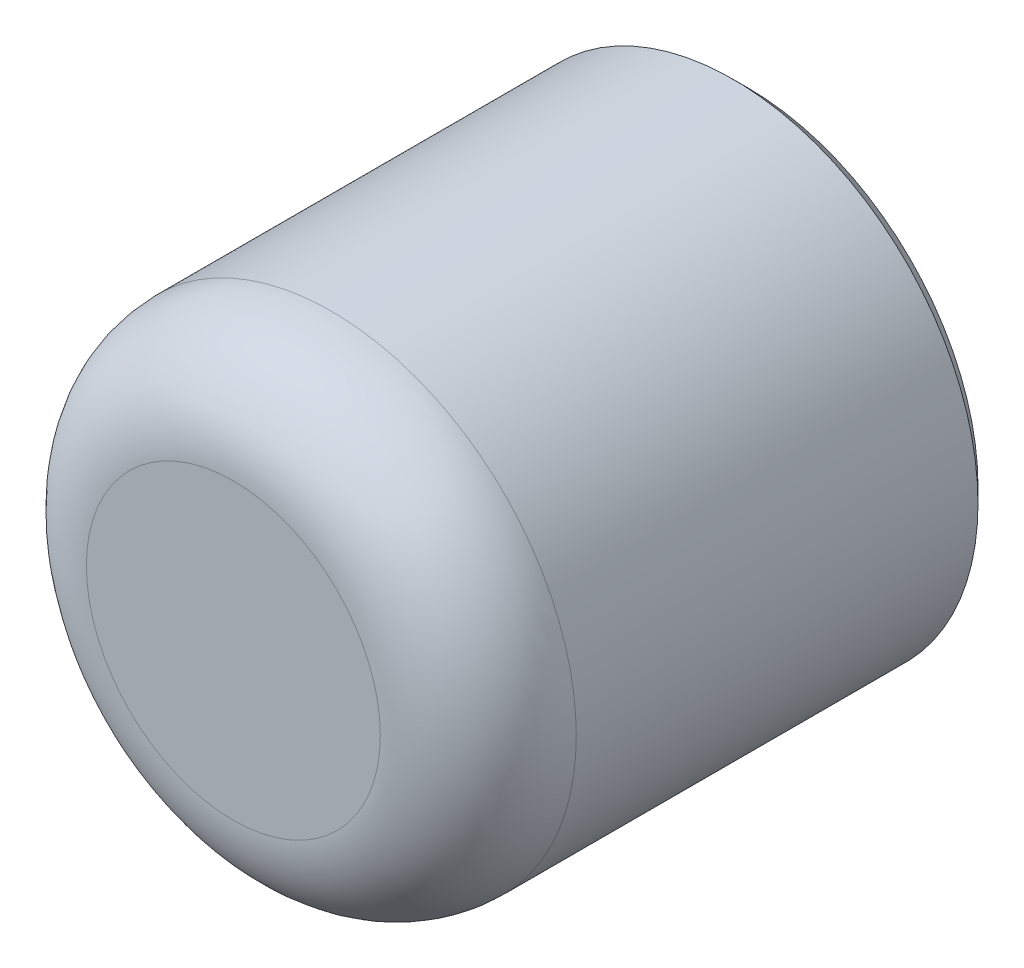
ISO-10303-21;
HEADER;
FILE_DESCRIPTION(('STEP AP214'),'2;1');
FILE_NAME('part.step','',(''),(''),'','','');
FILE_SCHEMA(('AUTOMOTIVE_DESIGN { 1 0 10303 214 1 1 1 1 }'));
ENDSEC;
DATA;
#1=APPLICATION_CONTEXT('core data for automotive mechanical design processes');
#2=APPLICATION_PROTOCOL_DEFINITION('international standard','automotive_design',2000,#1);
#3=PRODUCT_CONTEXT('',#1,'mechanical');
#4=PRODUCT('Part','Part','',(#3));
#5=PRODUCT_RELATED_PRODUCT_CATEGORY('part','',(#4));
#6=PRODUCT_DEFINITION_FORMATION('','',#4);
#7=PRODUCT_DEFINITION_CONTEXT('part definition',#1,'design');
#8=PRODUCT_DEFINITION('design','',#6,#7);
#9=PRODUCT_DEFINITION_SHAPE('','',#8);
#10=(LENGTH_UNIT() NAMED_UNIT(*) SI_UNIT(.MILLI.,.METRE.));
#11=(NAMED_UNIT(*) PLANE_ANGLE_UNIT() SI_UNIT($,.RADIAN.));
#12=(NAMED_UNIT(*) SI_UNIT($,.STERADIAN.) SOLID_ANGLE_UNIT());
#13=UNCERTAINTY_MEASURE_WITH_UNIT(LENGTH_MEASURE(1.E-05),#10,'distance_accuracy_value','');
#14=(GEOMETRIC_REPRESENTATION_CONTEXT(3) GLOBAL_UNCERTAINTY_ASSIGNED_CONTEXT((#13)) GLOBAL_UNIT_ASSIGNED_CONTEXT((#10,
#11,#12)) REPRESENTATION_CONTEXT('',''));
#15=CARTESIAN_POINT('',(0.,0.,0.));
#16=DIRECTION('',(0.,0.,1.));
#17=DIRECTION('',(1.,0.,0.));
#18=AXIS2_PLACEMENT_3D('',#15,#16,#17);
#19=CARTESIAN_POINT('',(0.,0.,8.5));
#20=DIRECTION('',(0.,0.,-1.));
#21=DIRECTION('',(-1.,0.,0.));
#22=AXIS2_PLACEMENT_3D('',#19,#20,#21);
#23=CYLINDRICAL_SURFACE('',#22,5.);
#24=CARTESIAN_POINT('',(0.,0.,0.300000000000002));
#25=DIRECTION('',(0.,0.,1.));
#26=DIRECTION('',(1.,0.,0.));
#27=AXIS2_PLACEMENT_3D('',#24,#25,#26);
#28=CIRCLE('',#27,5.);
#29=CARTESIAN_POINT('',(5.,0.,0.300000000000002));
#30=VERTEX_POINT('',#29);
#31=EDGE_CURVE('E49',#30,#30,#28,.T.);
#32=ORIENTED_EDGE('',*,*,#31,.T.);
#33=EDGE_LOOP('',(#32));
#34=FACE_BOUND('',#33,.T.);
#35=CARTESIAN_POINT('',(0.,0.,8.5));
#36=DIRECTION('',(0.,0.,1.));
#37=DIRECTION('',(1.,0.,0.));
#38=AXIS2_PLACEMENT_3D('',#35,#36,#37);
#39=CIRCLE('',#38,5.);
#40=CARTESIAN_POINT('',(5.,0.,8.5));
#41=VERTEX_POINT('',#40);
#42=EDGE_CURVE('E64',#41,#41,#39,.F.);
#43=ORIENTED_EDGE('',*,*,#42,.T.);
#44=EDGE_LOOP('',(#43));
#45=FACE_BOUND('',#44,.T.);
#46=ADVANCED_FACE('F38',(#34,#45),#23,.T.);
#47=CARTESIAN_POINT('',(0.,0.,0.));
#48=DIRECTION('',(0.,0.,1.));
#49=DIRECTION('',(1.,0.,0.));
#50=AXIS2_PLACEMENT_3D('',#47,#48,#49);
#51=PLANE('',#50);
#52=CARTESIAN_POINT('',(0.,0.,0.));
#53=DIRECTION('',(0.,0.,1.));
#54=DIRECTION('',(1.,0.,0.));
#55=AXIS2_PLACEMENT_3D('',#52,#53,#54);
#56=CIRCLE('',#55,3.69999999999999);
#57=CARTESIAN_POINT('',(3.69999999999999,0.,0.));
#58=VERTEX_POINT('',#57);
#59=EDGE_CURVE('E53',#58,#58,#56,.T.);
#60=ORIENTED_EDGE('',*,*,#59,.T.);
#61=EDGE_LOOP('',(#60));
#62=FACE_BOUND('',#61,.T.);
#63=CARTESIAN_POINT('',(0.,0.,0.));
#64=DIRECTION('',(0.,0.,1.));
#65=DIRECTION('',(1.,0.,0.));
#66=AXIS2_PLACEMENT_3D('',#63,#64,#65);
#67=CIRCLE('',#66,4.7);
#68=CARTESIAN_POINT('',(4.7,0.,0.));
#69=VERTEX_POINT('',#68);
#70=EDGE_CURVE('E58',#69,#69,#67,.F.);
#71=ORIENTED_EDGE('',*,*,#70,.T.);
#72=EDGE_LOOP('',(#71));
#73=FACE_BOUND('',#72,.T.);
#74=ADVANCED_FACE('F93',(#62,#73),#51,.F.);
#75=CARTESIAN_POINT('',(0.,0.,0.));
#76=DIRECTION('',(0.,0.,-1.));
#77=DIRECTION('',(-1.,0.,0.));
#78=AXIS2_PLACEMENT_3D('',#75,#76,#77);
#79=CYLINDRICAL_SURFACE('',#78,3.39999999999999);
#80=CARTESIAN_POINT('',(0.,0.,7.3));
#81=DIRECTION('',(0.,0.,-1.));
#82=DIRECTION('',(-1.,0.,0.));
#83=AXIS2_PLACEMENT_3D('',#80,#81,#82);
#84=CIRCLE('',#83,3.39999999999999);
#85=CARTESIAN_POINT('',(-3.39999999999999,0.,7.3));
#86=VERTEX_POINT('',#85);
#87=EDGE_CURVE('E45',#86,#86,#84,.F.);
#88=ORIENTED_EDGE('',*,*,#87,.T.);
#89=EDGE_LOOP('',(#88));
#90=FACE_BOUND('',#89,.T.);
#91=CARTESIAN_POINT('',(0.,0.,0.299999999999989));
#92=DIRECTION('',(0.,0.,1.));
#93=DIRECTION('',(1.,0.,0.));
#94=AXIS2_PLACEMENT_3D('',#91,#92,#93);
#95=CIRCLE('',#94,3.39999999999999);
#96=CARTESIAN_POINT('',(3.39999999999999,0.,0.299999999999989));
#97=VERTEX_POINT('',#96);
#98=EDGE_CURVE('E61',#97,#97,#95,.F.);
#99=ORIENTED_EDGE('',*,*,#98,.T.);
#100=EDGE_LOOP('',(#99));
#101=FACE_BOUND('',#100,.T.);
#102=ADVANCED_FACE('F99',(#90,#101),#79,.F.);
#103=CARTESIAN_POINT('',(0.,0.,10.5));
#104=DIRECTION('',(0.,0.,1.));
#105=DIRECTION('',(1.,0.,0.));
#106=AXIS2_PLACEMENT_3D('',#103,#104,#105);
#107=PLANE('',#106);
#108=CARTESIAN_POINT('',(0.,0.,10.5));
#109=DIRECTION('',(0.,0.,1.));
#110=DIRECTION('',(1.,0.,0.));
#111=AXIS2_PLACEMENT_3D('',#108,#109,#110);
#112=CIRCLE('',#111,3.);
#113=CARTESIAN_POINT('',(3.,0.,10.5));
#114=VERTEX_POINT('',#113);
#115=EDGE_CURVE('E67',#114,#114,#112,.T.);
#116=ORIENTED_EDGE('',*,*,#115,.T.);
#117=EDGE_LOOP('',(#116));
#118=FACE_BOUND('',#117,.T.);
#119=ADVANCED_FACE('F108',(#118),#107,.T.);
#120=CARTESIAN_POINT('',(0.,0.,8.5));
#121=DIRECTION('',(0.,0.,1.));
#122=DIRECTION('',(1.,0.,0.));
#123=AXIS2_PLACEMENT_3D('',#120,#121,#122);
#124=TOROIDAL_SURFACE('',#123,3.,2.);
#125=ORIENTED_EDGE('',*,*,#42,.F.);
#126=EDGE_LOOP('',(#125));
#127=FACE_BOUND('',#126,.T.);
#128=ORIENTED_EDGE('',*,*,#115,.F.);
#129=EDGE_LOOP('',(#128));
#130=FACE_BOUND('',#129,.T.);
#131=ADVANCED_FACE('F105',(#127,#130),#124,.T.);
#132=CARTESIAN_POINT('',(0.,0.,0.299999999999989));
#133=DIRECTION('',(0.,0.,-1.));
#134=DIRECTION('',(-1.,0.,0.));
#135=AXIS2_PLACEMENT_3D('',#132,#133,#134);
#136=CONICAL_SURFACE('',#135,3.39999999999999,0.785398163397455);
#137=ORIENTED_EDGE('',*,*,#59,.F.);
#138=EDGE_LOOP('',(#137));
#139=FACE_BOUND('',#138,.T.);
#140=ORIENTED_EDGE('',*,*,#98,.F.);
#141=EDGE_LOOP('',(#140));
#142=FACE_BOUND('',#141,.T.);
#143=ADVANCED_FACE('F90',(#139,#142),#136,.F.);
#144=CARTESIAN_POINT('',(0.,0.,0.300000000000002));
#145=DIRECTION('',(0.,0.,1.));
#146=DIRECTION('',(1.,0.,0.));
#147=AXIS2_PLACEMENT_3D('',#144,#145,#146);
#148=CONICAL_SURFACE('',#147,5.,0.785398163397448);
#149=ORIENTED_EDGE('',*,*,#70,.F.);
#150=EDGE_LOOP('',(#149));
#151=FACE_BOUND('',#150,.T.);
#152=ORIENTED_EDGE('',*,*,#31,.F.);
#153=EDGE_LOOP('',(#152));
#154=FACE_BOUND('',#153,.T.);
#155=ADVANCED_FACE('F82',(#151,#154),#148,.T.);
#156=CARTESIAN_POINT('',(0.,0.,7.5));
#157=DIRECTION('',(0.,0.,-1.));
#158=DIRECTION('',(-1.,0.,0.));
#159=AXIS2_PLACEMENT_3D('',#156,#157,#158);
#160=PLANE('',#159);
#161=CARTESIAN_POINT('',(0.,0.,7.5));
#162=DIRECTION('',(0.,0.,-1.));
#163=DIRECTION('',(-1.,0.,0.));
#164=AXIS2_PLACEMENT_3D('',#161,#162,#163);
#165=CIRCLE('',#164,3.59999999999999);
#166=CARTESIAN_POINT('',(-3.59999999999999,0.,7.5));
#167=VERTEX_POINT('',#166);
#168=EDGE_CURVE('E10',#167,#167,#165,.T.);
#169=ORIENTED_EDGE('',*,*,#168,.T.);
#170=EDGE_LOOP('',(#169));
#171=FACE_BOUND('',#170,.T.);
#172=CARTESIAN_POINT('',(0.,0.,7.5));
#173=DIRECTION('',(0.,0.,-1.));
#174=DIRECTION('',(-1.,0.,0.));
#175=AXIS2_PLACEMENT_3D('',#172,#173,#174);
#176=CIRCLE('',#175,4.);
#177=CARTESIAN_POINT('',(-4.,0.,7.5));
#178=VERTEX_POINT('',#177);
#179=EDGE_CURVE('E70',#178,#178,#176,.T.);
#180=ORIENTED_EDGE('',*,*,#179,.F.);
#181=EDGE_LOOP('',(#180));
#182=FACE_BOUND('',#181,.T.);
#183=ADVANCED_FACE('F80',(#171,#182),#160,.F.);
#184=CARTESIAN_POINT('',(0.,0.,7.5));
#185=DIRECTION('',(0.,0.,1.));
#186=DIRECTION('',(1.,0.,0.));
#187=AXIS2_PLACEMENT_3D('',#184,#185,#186);
#188=CYLINDRICAL_SURFACE('',#187,4.);
#189=ORIENTED_EDGE('',*,*,#179,.T.);
#190=EDGE_LOOP('',(#189));
#191=FACE_BOUND('',#190,.T.);
#192=CARTESIAN_POINT('',(0.,0.,8.5));
#193=DIRECTION('',(0.,0.,-1.));
#194=DIRECTION('',(-1.,0.,0.));
#195=AXIS2_PLACEMENT_3D('',#192,#193,#194);
#196=CIRCLE('',#195,4.);
#197=CARTESIAN_POINT('',(-4.,0.,8.5));
#198=VERTEX_POINT('',#197);
#199=EDGE_CURVE('E71',#198,#198,#196,.T.);
#200=ORIENTED_EDGE('',*,*,#199,.F.);
#201=EDGE_LOOP('',(#200));
#202=FACE_BOUND('',#201,.T.);
#203=ADVANCED_FACE('F77',(#191,#202),#188,.F.);
#204=CARTESIAN_POINT('',(0.,0.,8.5));
#205=DIRECTION('',(0.,0.,1.));
#206=DIRECTION('',(1.,0.,0.));
#207=AXIS2_PLACEMENT_3D('',#204,#205,#206);
#208=PLANE('',#207);
#209=ORIENTED_EDGE('',*,*,#199,.T.);
#210=EDGE_LOOP('',(#209));
#211=FACE_BOUND('',#210,.T.);
#212=ADVANCED_FACE('F88',(#211),#208,.F.);
#213=CARTESIAN_POINT('',(0.,0.,7.3));
#214=DIRECTION('',(0.,0.,1.));
#215=DIRECTION('',(1.,0.,0.));
#216=AXIS2_PLACEMENT_3D('',#213,#214,#215);
#217=CONICAL_SURFACE('',#216,3.39999999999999,0.785398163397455);
#218=ORIENTED_EDGE('',*,*,#168,.F.);
#219=EDGE_LOOP('',(#218));
#220=FACE_BOUND('',#219,.T.);
#221=ORIENTED_EDGE('',*,*,#87,.F.);
#222=EDGE_LOOP('',(#221));
#223=FACE_BOUND('',#222,.T.);
#224=ADVANCED_FACE('F40',(#220,#223),#217,.F.);
#225=CLOSED_SHELL('',(#46,#74,#102,#119,#131,#143,#155,#183,#203,#212,#224));
#226=MANIFOLD_SOLID_BREP('B2',#225);
#227=ADVANCED_BREP_SHAPE_REPRESENTATION('',(#18,#226),#14);
#228=SHAPE_DEFINITION_REPRESENTATION(#9,#227);
ENDSEC;
END-ISO-10303-21;
